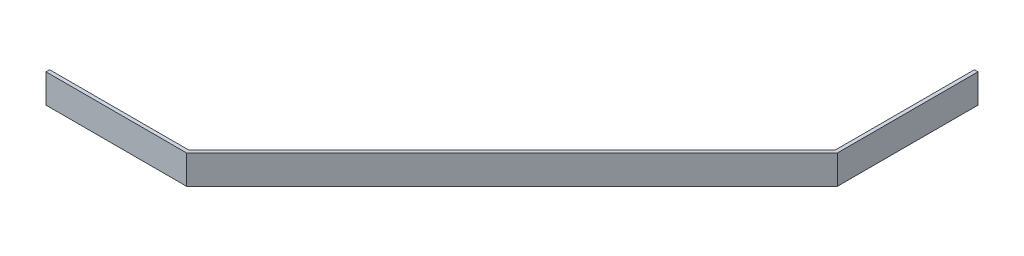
from build123d import *

# Parameters (mm, degrees)
BOSS_EXTRUDE1_DEPTH = 76.2


with BuildPart() as part:
    # Sketch1 → Boss-Extrude1 (new body)
    with BuildSketch(Plane(origin=(0, 0, 0), x_dir=(1, 0, 0), z_dir=(0, 1, 0))):
        Polygon((0, 0), (366.7125, 0), (1219.2, 852.4875), (1219.2, 1219.2), (1228.725, 1219.2), (1228.725, 848.542115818), (370.657884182, -9.525), (0, -9.525), align=None)
    extrude(amount=BOSS_EXTRUDE1_DEPTH)


solid = part.part
